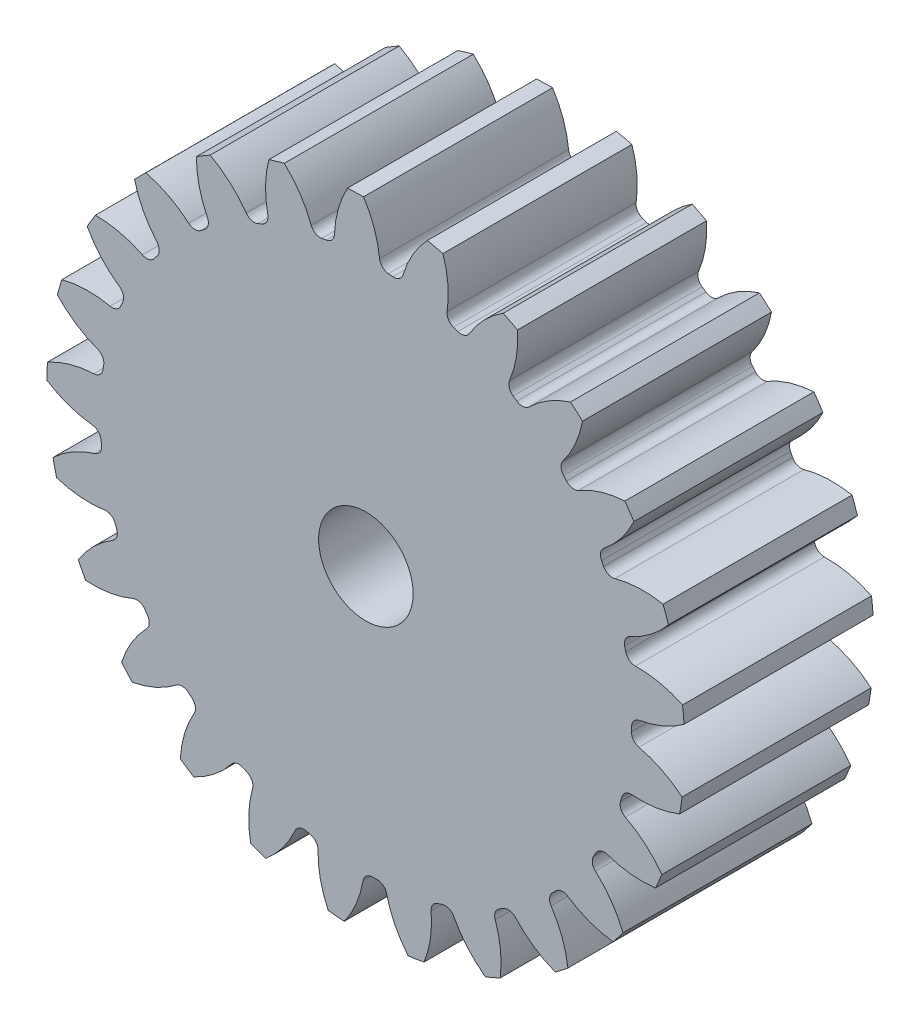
from build123d import *

# Parameters (mm, degrees)
SKETCH3_R         = 171.45
GEARBODY_DEPTH    = 101.6
TOOTHCUT_DEPTH    = 263.893067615
CIRPATTERN1_COUNT = 25
BOREDIA_R         = 25.4
BORE_DEPTH        = 12700


with BuildPart() as part:
    # Sketch3 → gearBody (new body)
    with BuildSketch(Plane.XY):
        Circle(SKETCH3_R)
    extrude(amount=GEARBODY_DEPTH)

    # Sketch2 → toothCut (cut, through all)
    with BuildSketch(Plane.XY):
        with BuildLine():
            ThreePointArc((142.766503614, -5.566962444), (142.809259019, -4.333723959), (142.841361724, -3.100162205))
            ThreePointArc((142.841361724, -3.100162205), (144.097781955, 0.166963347), (147.147913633, 1.884344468))
            ThreePointArc((147.147913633, 1.884344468), (159.924558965, 5.650096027), (171.45, 12.327502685))
            ThreePointArc((171.45, 12.327502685), (171.813518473, -5.213894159), (170.387017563, -22.700970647))
            ThreePointArc((170.387017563, -22.700970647), (159.287679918, -15.336987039), (146.762887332, -10.803431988))
            ThreePointArc((146.762887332, -10.803431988), (143.822504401, -8.904261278), (142.766503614, -5.566962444))
        make_face()
    toothcut = extrude(amount=TOOTHCUT_DEPTH, mode=Mode.SUBTRACT)

    # CirPattern1: toothCut ×25 about axis
    cirpattern1_axis = Axis((0, 0, 0), (0, 0, 1))
    for i in range(1, CIRPATTERN1_COUNT):
        add(toothcut.rotate(cirpattern1_axis, i * 360 / CIRPATTERN1_COUNT), mode=Mode.SUBTRACT)

    # boreDia → bore (cut, symmetric)
    with BuildSketch(Plane.XY):
        Circle(BOREDIA_R)
    extrude(amount=BORE_DEPTH, both=True, mode=Mode.SUBTRACT)


solid = part.part
